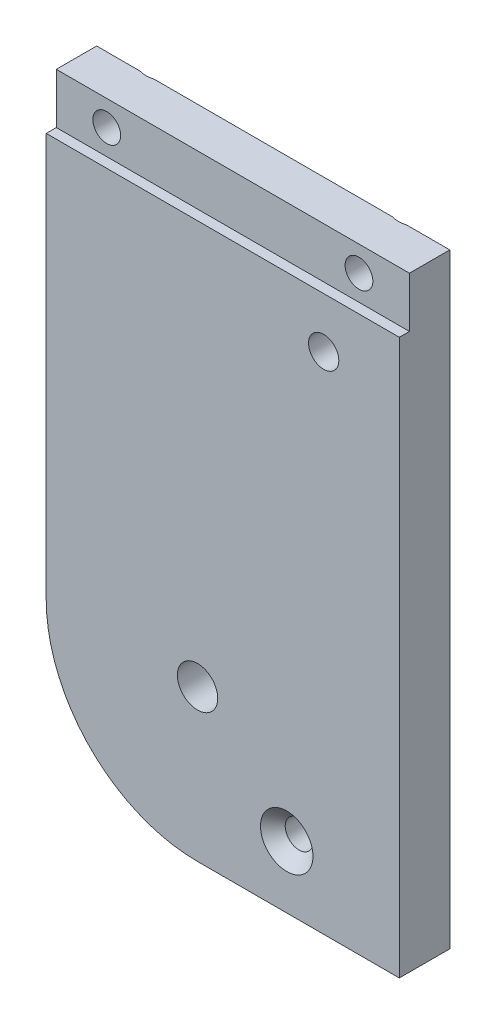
ISO-10303-21;
HEADER;
FILE_DESCRIPTION(('STEP AP214'),'2;1');
FILE_NAME('part.step','',(''),(''),'','','');
FILE_SCHEMA(('AUTOMOTIVE_DESIGN { 1 0 10303 214 1 1 1 1 }'));
ENDSEC;
DATA;
#1=APPLICATION_CONTEXT('core data for automotive mechanical design processes');
#2=APPLICATION_PROTOCOL_DEFINITION('international standard','automotive_design',2000,#1);
#3=PRODUCT_CONTEXT('',#1,'mechanical');
#4=PRODUCT('Part','Part','',(#3));
#5=PRODUCT_RELATED_PRODUCT_CATEGORY('part','',(#4));
#6=PRODUCT_DEFINITION_FORMATION('','',#4);
#7=PRODUCT_DEFINITION_CONTEXT('part definition',#1,'design');
#8=PRODUCT_DEFINITION('design','',#6,#7);
#9=PRODUCT_DEFINITION_SHAPE('','',#8);
#10=(LENGTH_UNIT() NAMED_UNIT(*) SI_UNIT(.MILLI.,.METRE.));
#11=(NAMED_UNIT(*) PLANE_ANGLE_UNIT() SI_UNIT($,.RADIAN.));
#12=(NAMED_UNIT(*) SI_UNIT($,.STERADIAN.) SOLID_ANGLE_UNIT());
#13=UNCERTAINTY_MEASURE_WITH_UNIT(LENGTH_MEASURE(1.E-05),#10,'distance_accuracy_value','');
#14=(GEOMETRIC_REPRESENTATION_CONTEXT(3) GLOBAL_UNCERTAINTY_ASSIGNED_CONTEXT((#13)) GLOBAL_UNIT_ASSIGNED_CONTEXT((#10,
#11,#12)) REPRESENTATION_CONTEXT('',''));
#15=CARTESIAN_POINT('',(0.,0.,0.));
#16=DIRECTION('',(0.,0.,1.));
#17=DIRECTION('',(1.,0.,0.));
#18=AXIS2_PLACEMENT_3D('',#15,#16,#17);
#19=CARTESIAN_POINT('',(-50.,45.,10.));
#20=DIRECTION('',(0.,0.,1.));
#21=DIRECTION('',(1.,0.,0.));
#22=AXIS2_PLACEMENT_3D('',#19,#20,#21);
#23=PLANE('',#22);
#24=CARTESIAN_POINT('',(-32.3223304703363,27.3223304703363,10.));
#25=DIRECTION('',(0.,0.,1.));
#26=DIRECTION('',(1.,0.,0.));
#27=AXIS2_PLACEMENT_3D('',#24,#25,#26);
#28=CIRCLE('',#27,5.2);
#29=CARTESIAN_POINT('',(-27.1223304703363,27.3223304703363,10.));
#30=VERTEX_POINT('',#29);
#31=EDGE_CURVE('E184',#30,#30,#28,.T.);
#32=ORIENTED_EDGE('',*,*,#31,.F.);
#33=EDGE_LOOP('',(#32));
#34=FACE_BOUND('',#33,.T.);
#35=CARTESIAN_POINT('',(-25.,115.,10.));
#36=DIRECTION('',(0.,0.,1.));
#37=DIRECTION('',(1.,0.,0.));
#38=AXIS2_PLACEMENT_3D('',#35,#36,#37);
#39=CIRCLE('',#38,3.);
#40=CARTESIAN_POINT('',(-22.,115.,10.));
#41=VERTEX_POINT('',#40);
#42=EDGE_CURVE('E173',#41,#41,#39,.T.);
#43=ORIENTED_EDGE('',*,*,#42,.F.);
#44=EDGE_LOOP('',(#43));
#45=FACE_BOUND('',#44,.T.);
#46=DIRECTION('',(1.,0.,0.));
#47=VECTOR('',#46,1.);
#48=CARTESIAN_POINT('',(-80.,125.,10.));
#49=LINE('',#48,#47);
#50=CARTESIAN_POINT('',(-80.,125.,10.));
#51=VERTEX_POINT('',#50);
#52=CARTESIAN_POINT('',(-10.,125.,10.));
#53=VERTEX_POINT('',#52);
#54=EDGE_CURVE('E156',#51,#53,#49,.T.);
#55=ORIENTED_EDGE('',*,*,#54,.F.);
#56=DIRECTION('',(0.,-1.,0.));
#57=VECTOR('',#56,1.);
#58=CARTESIAN_POINT('',(-80.,135.,10.));
#59=LINE('',#58,#57);
#60=CARTESIAN_POINT('',(-80.,45.,10.));
#61=VERTEX_POINT('',#60);
#62=EDGE_CURVE('E121',#51,#61,#59,.T.);
#63=ORIENTED_EDGE('',*,*,#62,.T.);
#64=CARTESIAN_POINT('',(-50.,45.,10.));
#65=DIRECTION('',(0.,0.,1.));
#66=DIRECTION('',(1.,0.,0.));
#67=AXIS2_PLACEMENT_3D('',#64,#65,#66);
#68=CIRCLE('',#67,30.);
#69=CARTESIAN_POINT('',(-50.,15.,10.));
#70=VERTEX_POINT('',#69);
#71=EDGE_CURVE('E124',#61,#70,#68,.T.);
#72=ORIENTED_EDGE('',*,*,#71,.T.);
#73=DIRECTION('',(1.,0.,0.));
#74=VECTOR('',#73,1.);
#75=CARTESIAN_POINT('',(-50.,15.,10.));
#76=LINE('',#75,#74);
#77=CARTESIAN_POINT('',(-9.99999999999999,15.,10.));
#78=VERTEX_POINT('',#77);
#79=EDGE_CURVE('E147',#70,#78,#76,.T.);
#80=ORIENTED_EDGE('',*,*,#79,.T.);
#81=DIRECTION('',(0.,1.,0.));
#82=VECTOR('',#81,1.);
#83=CARTESIAN_POINT('',(-10.,135.,10.));
#84=LINE('',#83,#82);
#85=EDGE_CURVE('E143',#78,#53,#84,.T.);
#86=ORIENTED_EDGE('',*,*,#85,.T.);
#87=EDGE_LOOP('',(#55,#63,#72,#80,#86));
#88=FACE_BOUND('',#87,.T.);
#89=CARTESIAN_POINT('',(-50.,45.,10.));
#90=DIRECTION('',(0.,0.,1.));
#91=DIRECTION('',(1.,0.,0.));
#92=AXIS2_PLACEMENT_3D('',#89,#90,#91);
#93=CIRCLE('',#92,4.00000000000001);
#94=CARTESIAN_POINT('',(-46.,45.,10.));
#95=VERTEX_POINT('',#94);
#96=EDGE_CURVE('E142',#95,#95,#93,.T.);
#97=ORIENTED_EDGE('',*,*,#96,.F.);
#98=EDGE_LOOP('',(#97));
#99=FACE_BOUND('',#98,.T.);
#100=ADVANCED_FACE('F34',(#34,#45,#88,#99),#23,.T.);
#101=CARTESIAN_POINT('',(-50.,45.,0.));
#102=DIRECTION('',(0.,0.,1.));
#103=DIRECTION('',(1.,0.,0.));
#104=AXIS2_PLACEMENT_3D('',#101,#102,#103);
#105=PLANE('',#104);
#106=CARTESIAN_POINT('',(-32.3223304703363,27.3223304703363,0.));
#107=DIRECTION('',(0.,0.,1.));
#108=DIRECTION('',(1.,0.,0.));
#109=AXIS2_PLACEMENT_3D('',#106,#107,#108);
#110=CIRCLE('',#109,2.74999999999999);
#111=CARTESIAN_POINT('',(-29.5723304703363,27.3223304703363,0.));
#112=VERTEX_POINT('',#111);
#113=EDGE_CURVE('E176',#112,#112,#110,.T.);
#114=ORIENTED_EDGE('',*,*,#113,.T.);
#115=EDGE_LOOP('',(#114));
#116=FACE_BOUND('',#115,.T.);
#117=CARTESIAN_POINT('',(-25.,115.,0.));
#118=DIRECTION('',(0.,0.,1.));
#119=DIRECTION('',(1.,0.,0.));
#120=AXIS2_PLACEMENT_3D('',#117,#118,#119);
#121=CIRCLE('',#120,3.);
#122=CARTESIAN_POINT('',(-22.,115.,0.));
#123=VERTEX_POINT('',#122);
#124=EDGE_CURVE('E168',#123,#123,#121,.T.);
#125=ORIENTED_EDGE('',*,*,#124,.T.);
#126=EDGE_LOOP('',(#125));
#127=FACE_BOUND('',#126,.T.);
#128=DIRECTION('',(-1.,0.,0.));
#129=VECTOR('',#128,1.);
#130=CARTESIAN_POINT('',(-80.,135.,0.));
#131=LINE('',#130,#129);
#132=CARTESIAN_POINT('',(-21.4282856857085,135.,0.));
#133=VERTEX_POINT('',#132);
#134=CARTESIAN_POINT('',(-68.5717143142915,135.,0.));
#135=VERTEX_POINT('',#134);
#136=EDGE_CURVE('E113',#133,#135,#131,.T.);
#137=ORIENTED_EDGE('',*,*,#136,.F.);
#138=CARTESIAN_POINT('',(-20.,130.,0.));
#139=DIRECTION('',(0.,0.,-1.));
#140=DIRECTION('',(-1.,0.,0.));
#141=AXIS2_PLACEMENT_3D('',#138,#139,#140);
#142=CIRCLE('',#141,5.2);
#143=CARTESIAN_POINT('',(-18.5717143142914,135.,0.));
#144=VERTEX_POINT('',#143);
#145=EDGE_CURVE('E49',#144,#133,#142,.T.);
#146=ORIENTED_EDGE('',*,*,#145,.F.);
#147=CARTESIAN_POINT('',(-10.,135.,0.));
#148=VERTEX_POINT('',#147);
#149=EDGE_CURVE('E112',#148,#144,#131,.T.);
#150=ORIENTED_EDGE('',*,*,#149,.F.);
#151=DIRECTION('',(0.,1.,0.));
#152=VECTOR('',#151,1.);
#153=CARTESIAN_POINT('',(-10.,135.,0.));
#154=LINE('',#153,#152);
#155=CARTESIAN_POINT('',(-9.99999999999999,15.,0.));
#156=VERTEX_POINT('',#155);
#157=EDGE_CURVE('E128',#156,#148,#154,.T.);
#158=ORIENTED_EDGE('',*,*,#157,.F.);
#159=DIRECTION('',(1.,0.,0.));
#160=VECTOR('',#159,1.);
#161=CARTESIAN_POINT('',(-50.,15.,0.));
#162=LINE('',#161,#160);
#163=CARTESIAN_POINT('',(-50.,15.,0.));
#164=VERTEX_POINT('',#163);
#165=EDGE_CURVE('E132',#164,#156,#162,.T.);
#166=ORIENTED_EDGE('',*,*,#165,.F.);
#167=CARTESIAN_POINT('',(-50.,45.,0.));
#168=DIRECTION('',(0.,0.,1.));
#169=DIRECTION('',(1.,0.,0.));
#170=AXIS2_PLACEMENT_3D('',#167,#168,#169);
#171=CIRCLE('',#170,30.);
#172=CARTESIAN_POINT('',(-80.,45.,0.));
#173=VERTEX_POINT('',#172);
#174=EDGE_CURVE('E135',#173,#164,#171,.T.);
#175=ORIENTED_EDGE('',*,*,#174,.F.);
#176=DIRECTION('',(0.,-1.,0.));
#177=VECTOR('',#176,1.);
#178=CARTESIAN_POINT('',(-80.,135.,0.));
#179=LINE('',#178,#177);
#180=CARTESIAN_POINT('',(-80.,135.,0.));
#181=VERTEX_POINT('',#180);
#182=EDGE_CURVE('E139',#181,#173,#179,.T.);
#183=ORIENTED_EDGE('',*,*,#182,.F.);
#184=CARTESIAN_POINT('',(-71.4282856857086,135.,0.));
#185=VERTEX_POINT('',#184);
#186=EDGE_CURVE('E123',#185,#181,#131,.T.);
#187=ORIENTED_EDGE('',*,*,#186,.F.);
#188=CARTESIAN_POINT('',(-70.,130.,0.));
#189=DIRECTION('',(0.,0.,-1.));
#190=DIRECTION('',(-1.,0.,0.));
#191=AXIS2_PLACEMENT_3D('',#188,#189,#190);
#192=CIRCLE('',#191,5.2);
#193=EDGE_CURVE('E55',#135,#185,#192,.T.);
#194=ORIENTED_EDGE('',*,*,#193,.F.);
#195=EDGE_LOOP('',(#137,#146,#150,#158,#166,#175,#183,#187,#194));
#196=FACE_BOUND('',#195,.T.);
#197=CARTESIAN_POINT('',(-50.,45.,0.));
#198=DIRECTION('',(0.,0.,1.));
#199=DIRECTION('',(1.,0.,0.));
#200=AXIS2_PLACEMENT_3D('',#197,#198,#199);
#201=CIRCLE('',#200,4.00000000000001);
#202=CARTESIAN_POINT('',(-46.,45.,0.));
#203=VERTEX_POINT('',#202);
#204=EDGE_CURVE('E150',#203,#203,#201,.T.);
#205=ORIENTED_EDGE('',*,*,#204,.T.);
#206=EDGE_LOOP('',(#205));
#207=FACE_BOUND('',#206,.T.);
#208=ADVANCED_FACE('F109',(#116,#127,#196,#207),#105,.F.);
#209=CARTESIAN_POINT('',(-80.,135.,10.));
#210=DIRECTION('',(1.,0.,0.));
#211=DIRECTION('',(0.,1.,0.));
#212=AXIS2_PLACEMENT_3D('',#209,#210,#211);
#213=PLANE('',#212);
#214=DIRECTION('',(0.,0.,-1.));
#215=VECTOR('',#214,1.);
#216=CARTESIAN_POINT('',(-80.,125.,10.));
#217=LINE('',#216,#215);
#218=CARTESIAN_POINT('',(-80.,125.,8.));
#219=VERTEX_POINT('',#218);
#220=EDGE_CURVE('E164',#51,#219,#217,.T.);
#221=ORIENTED_EDGE('',*,*,#220,.T.);
#222=DIRECTION('',(0.,1.,0.));
#223=VECTOR('',#222,1.);
#224=CARTESIAN_POINT('',(-80.,135.,8.));
#225=LINE('',#224,#223);
#226=CARTESIAN_POINT('',(-80.,135.,8.));
#227=VERTEX_POINT('',#226);
#228=EDGE_CURVE('E159',#219,#227,#225,.T.);
#229=ORIENTED_EDGE('',*,*,#228,.T.);
#230=DIRECTION('',(0.,0.,-1.));
#231=VECTOR('',#230,1.);
#232=CARTESIAN_POINT('',(-80.,135.,10.));
#233=LINE('',#232,#231);
#234=EDGE_CURVE('E146',#227,#181,#233,.T.);
#235=ORIENTED_EDGE('',*,*,#234,.T.);
#236=ORIENTED_EDGE('',*,*,#182,.T.);
#237=DIRECTION('',(0.,0.,-1.));
#238=VECTOR('',#237,1.);
#239=CARTESIAN_POINT('',(-80.,45.,10.));
#240=LINE('',#239,#238);
#241=EDGE_CURVE('E286',#61,#173,#240,.T.);
#242=ORIENTED_EDGE('',*,*,#241,.F.);
#243=ORIENTED_EDGE('',*,*,#62,.F.);
#244=EDGE_LOOP('',(#221,#229,#235,#236,#242,#243));
#245=FACE_BOUND('',#244,.T.);
#246=ADVANCED_FACE('F36',(#245),#213,.F.);
#247=CARTESIAN_POINT('',(-50.,45.,10.));
#248=DIRECTION('',(0.,0.,-1.));
#249=DIRECTION('',(-1.,0.,0.));
#250=AXIS2_PLACEMENT_3D('',#247,#248,#249);
#251=CYLINDRICAL_SURFACE('',#250,30.);
#252=ORIENTED_EDGE('',*,*,#174,.T.);
#253=DIRECTION('',(0.,0.,-1.));
#254=VECTOR('',#253,1.);
#255=CARTESIAN_POINT('',(-50.,15.,10.));
#256=LINE('',#255,#254);
#257=EDGE_CURVE('E284',#70,#164,#256,.T.);
#258=ORIENTED_EDGE('',*,*,#257,.F.);
#259=ORIENTED_EDGE('',*,*,#71,.F.);
#260=ORIENTED_EDGE('',*,*,#241,.T.);
#261=EDGE_LOOP('',(#252,#258,#259,#260));
#262=FACE_BOUND('',#261,.T.);
#263=ADVANCED_FACE('F296',(#262),#251,.T.);
#264=CARTESIAN_POINT('',(-50.,15.,10.));
#265=DIRECTION('',(0.,1.,0.));
#266=DIRECTION('',(0.,0.,1.));
#267=AXIS2_PLACEMENT_3D('',#264,#265,#266);
#268=PLANE('',#267);
#269=ORIENTED_EDGE('',*,*,#165,.T.);
#270=DIRECTION('',(0.,0.,-1.));
#271=VECTOR('',#270,1.);
#272=CARTESIAN_POINT('',(-9.99999999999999,15.,10.));
#273=LINE('',#272,#271);
#274=EDGE_CURVE('E280',#78,#156,#273,.T.);
#275=ORIENTED_EDGE('',*,*,#274,.F.);
#276=ORIENTED_EDGE('',*,*,#79,.F.);
#277=ORIENTED_EDGE('',*,*,#257,.T.);
#278=EDGE_LOOP('',(#269,#275,#276,#277));
#279=FACE_BOUND('',#278,.T.);
#280=ADVANCED_FACE('F300',(#279),#268,.F.);
#281=CARTESIAN_POINT('',(-10.,135.,10.));
#282=DIRECTION('',(-1.,0.,0.));
#283=DIRECTION('',(0.,-1.,0.));
#284=AXIS2_PLACEMENT_3D('',#281,#282,#283);
#285=PLANE('',#284);
#286=DIRECTION('',(0.,0.,-1.));
#287=VECTOR('',#286,1.);
#288=CARTESIAN_POINT('',(-10.,135.,10.));
#289=LINE('',#288,#287);
#290=CARTESIAN_POINT('',(-10.,135.,8.));
#291=VERTEX_POINT('',#290);
#292=EDGE_CURVE('E119',#291,#148,#289,.T.);
#293=ORIENTED_EDGE('',*,*,#292,.F.);
#294=DIRECTION('',(0.,1.,0.));
#295=VECTOR('',#294,1.);
#296=CARTESIAN_POINT('',(-10.,135.,8.));
#297=LINE('',#296,#295);
#298=CARTESIAN_POINT('',(-10.,125.,8.));
#299=VERTEX_POINT('',#298);
#300=EDGE_CURVE('E162',#299,#291,#297,.T.);
#301=ORIENTED_EDGE('',*,*,#300,.F.);
#302=DIRECTION('',(0.,0.,-1.));
#303=VECTOR('',#302,1.);
#304=CARTESIAN_POINT('',(-10.,125.,10.));
#305=LINE('',#304,#303);
#306=EDGE_CURVE('E165',#53,#299,#305,.T.);
#307=ORIENTED_EDGE('',*,*,#306,.F.);
#308=ORIENTED_EDGE('',*,*,#85,.F.);
#309=ORIENTED_EDGE('',*,*,#274,.T.);
#310=ORIENTED_EDGE('',*,*,#157,.T.);
#311=EDGE_LOOP('',(#293,#301,#307,#308,#309,#310));
#312=FACE_BOUND('',#311,.T.);
#313=ADVANCED_FACE('F231',(#312),#285,.F.);
#314=CARTESIAN_POINT('',(-80.,135.,10.));
#315=DIRECTION('',(0.,-1.,0.));
#316=DIRECTION('',(0.,0.,-1.));
#317=AXIS2_PLACEMENT_3D('',#314,#315,#316);
#318=PLANE('',#317);
#319=ORIENTED_EDGE('',*,*,#149,.T.);
#320=CARTESIAN_POINT('',(-37.1405688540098,135.,-12.6549461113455));
#321=CARTESIAN_POINT('',(-36.715837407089,135.,-12.247244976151));
#322=CARTESIAN_POINT('',(-36.2905460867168,135.,-11.8401243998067));
#323=CARTESIAN_POINT('',(-35.4384550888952,135.,-11.027420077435));
#324=CARTESIAN_POINT('',(-35.0116553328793,135.,-10.6218364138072));
#325=CARTESIAN_POINT('',(-34.1550195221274,135.,-9.81150466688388));
#326=CARTESIAN_POINT('',(-33.725178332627,135.,-9.40676200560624));
#327=CARTESIAN_POINT('',(-32.8631011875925,135.,-8.59986764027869));
#328=CARTESIAN_POINT('',(-32.4308653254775,135.,-8.19771583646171));
#329=CARTESIAN_POINT('',(-31.5114851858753,135.,-7.34907007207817));
#330=CARTESIAN_POINT('',(-31.023940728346,135.,-6.9030082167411));
#331=CARTESIAN_POINT('',(-30.2883897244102,135.,-6.23853245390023));
#332=CARTESIAN_POINT('',(-30.0424828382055,135.,-6.01779462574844));
#333=CARTESIAN_POINT('',(-29.5489697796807,135.,-5.57822809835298));
#334=CARTESIAN_POINT('',(-29.3013636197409,135.,-5.35939938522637));
#335=CARTESIAN_POINT('',(-28.8044825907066,135.,-4.92445100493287));
#336=CARTESIAN_POINT('',(-28.5552110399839,135.,-4.70832755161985));
#337=CARTESIAN_POINT('',(-28.0541310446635,135.,-4.27904577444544));
#338=CARTESIAN_POINT('',(-27.8023226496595,135.,-4.06588739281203));
#339=CARTESIAN_POINT('',(-27.2955867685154,135.,-3.64341598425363));
#340=CARTESIAN_POINT('',(-27.0406599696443,135.,-3.4341021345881));
#341=CARTESIAN_POINT('',(-26.5268054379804,135.,-3.0204556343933));
#342=CARTESIAN_POINT('',(-26.2678779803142,135.,-2.816122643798));
#343=CARTESIAN_POINT('',(-25.8388641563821,135.,-2.48641001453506));
#344=CARTESIAN_POINT('',(-25.6702994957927,135.,-2.35905205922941));
#345=CARTESIAN_POINT('',(-25.3306506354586,135.,-2.10771974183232));
#346=CARTESIAN_POINT('',(-25.1595663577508,135.,-1.98374548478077));
#347=CARTESIAN_POINT('',(-24.8141013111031,135.,-1.73978264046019));
#348=CARTESIAN_POINT('',(-24.6397150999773,135.,-1.61980173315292));
#349=CARTESIAN_POINT('',(-24.2873890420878,135.,-1.38516706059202));
#350=CARTESIAN_POINT('',(-24.109449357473,135.,-1.27051305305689));
#351=CARTESIAN_POINT('',(-23.7530138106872,135.,-1.05026990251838));
#352=CARTESIAN_POINT('',(-23.5746031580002,135.,-0.944543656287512));
#353=CARTESIAN_POINT('',(-23.2129842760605,135.,-0.741454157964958));
#354=CARTESIAN_POINT('',(-23.0297748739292,135.,-0.644092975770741));
#355=CARTESIAN_POINT('',(-22.6585047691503,135.,-0.460537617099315));
#356=CARTESIAN_POINT('',(-22.4704609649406,135.,-0.374309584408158));
#357=CARTESIAN_POINT('',(-22.0885962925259,135.,-0.215913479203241));
#358=CARTESIAN_POINT('',(-21.8947801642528,135.,-0.14373421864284));
#359=CARTESIAN_POINT('',(-21.5737570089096,135.,-0.0405016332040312));
#360=CARTESIAN_POINT('',(-21.4482721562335,135.,-0.00408671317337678));
#361=CARTESIAN_POINT('',(-21.1951822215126,135.,0.0605935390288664));
#362=CARTESIAN_POINT('',(-21.0675769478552,135.,0.0888581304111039));
#363=CARTESIAN_POINT('',(-20.8110095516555,135.,0.1362174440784));
#364=CARTESIAN_POINT('',(-20.6820519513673,135.,0.155336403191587));
#365=CARTESIAN_POINT('',(-20.423062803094,135.,0.183784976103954));
#366=CARTESIAN_POINT('',(-20.2930313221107,135.,0.193115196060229));
#367=CARTESIAN_POINT('',(-20.0047245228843,135.,0.20249093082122));
#368=CARTESIAN_POINT('',(-19.8463638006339,135.,0.20012036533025));
#369=CARTESIAN_POINT('',(-19.5305720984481,135.,0.180487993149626));
#370=CARTESIAN_POINT('',(-19.3731412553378,135.,0.163224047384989));
#371=CARTESIAN_POINT('',(-19.059808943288,135.,0.114738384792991));
#372=CARTESIAN_POINT('',(-18.9039164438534,135.,0.0834594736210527));
#373=CARTESIAN_POINT('',(-18.5951683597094,135.,0.00855445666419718));
#374=CARTESIAN_POINT('',(-18.4423131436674,135.,-0.035073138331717));
#375=CARTESIAN_POINT('',(-17.9909544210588,135.,-0.18102628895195));
#376=CARTESIAN_POINT('',(-17.6974212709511,135.,-0.29881796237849));
#377=CARTESIAN_POINT('',(-17.2671339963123,135.,-0.496694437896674));
#378=CARTESIAN_POINT('',(-17.1252372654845,135.,-0.566264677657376));
#379=CARTESIAN_POINT('',(-16.8444604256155,135.,-0.711258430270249));
#380=CARTESIAN_POINT('',(-16.7055798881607,135.,-0.786681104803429));
#381=CARTESIAN_POINT('',(-16.4286000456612,135.,-0.943425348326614));
#382=CARTESIAN_POINT('',(-16.2905399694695,135.,-1.02481557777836));
#383=CARTESIAN_POINT('',(-16.0169002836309,135.,-1.19166077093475));
#384=CARTESIAN_POINT('',(-15.8813207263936,135.,-1.2771158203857));
#385=CARTESIAN_POINT('',(-15.6124622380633,135.,-1.45131623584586));
#386=CARTESIAN_POINT('',(-15.4791814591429,135.,-1.54005875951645));
#387=CARTESIAN_POINT('',(-15.2145445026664,135.,-1.72034886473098));
#388=CARTESIAN_POINT('',(-15.0831882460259,135.,-1.81189633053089));
#389=CARTESIAN_POINT('',(-14.6528731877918,135.,-2.11758394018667));
#390=CARTESIAN_POINT('',(-14.3574773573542,135.,-2.3367415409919));
#391=CARTESIAN_POINT('',(-13.7731960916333,135.,-2.78359714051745));
#392=CARTESIAN_POINT('',(-13.4843119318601,135.,-3.01129678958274));
#393=CARTESIAN_POINT('',(-12.9113238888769,135.,-3.47297769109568));
#394=CARTESIAN_POINT('',(-12.627223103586,135.,-3.7069627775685));
#395=CARTESIAN_POINT('',(-12.0628646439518,135.,-4.17946424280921));
#396=CARTESIAN_POINT('',(-11.782606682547,135.,-4.41798027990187));
#397=CARTESIAN_POINT('',(-11.2243414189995,135.,-4.89911415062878));
#398=CARTESIAN_POINT('',(-10.9463420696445,135.,-5.14174119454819));
#399=CARTESIAN_POINT('',(-10.3927297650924,135.,-5.62970750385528));
#400=CARTESIAN_POINT('',(-10.1171168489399,135.,-5.87504681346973));
#401=CARTESIAN_POINT('',(-9.56791837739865,135.,-6.36778414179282));
#402=CARTESIAN_POINT('',(-9.29433212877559,135.,-6.61518138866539));
#403=CARTESIAN_POINT('',(-8.74873623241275,135.,-7.11170914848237));
#404=CARTESIAN_POINT('',(-8.4767265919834,135.,-7.36083966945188));
#405=CARTESIAN_POINT('',(-7.72906189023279,135.,-8.04919672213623));
#406=CARTESIAN_POINT('',(-7.25475730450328,135.,-8.4898897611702));
#407=CARTESIAN_POINT('',(-6.30903454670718,135.,-9.37445352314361));
#408=CARTESIAN_POINT('',(-5.83761667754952,135.,-9.81832456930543));
#409=CARTESIAN_POINT('',(-4.89930094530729,135.,-10.7062286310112));
#410=CARTESIAN_POINT('',(-4.43239225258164,135.,-11.1502502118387));
#411=CARTESIAN_POINT('',(-3.50036096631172,135.,-12.0400507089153));
#412=CARTESIAN_POINT('',(-3.03523816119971,135.,-12.4858294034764));
#413=CARTESIAN_POINT('',(-2.5707465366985,135.,-12.9322606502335));
#414=B_SPLINE_CURVE_WITH_KNOTS('',3,(#320,#321,#322,#323,#324,#325,#326,#327,#328,#329,#330,
#331,#332,#333,#334,#335,#336,#337,#338,#339,#340,#341,#342,#343,#344,#345,#346,#347,#348,#349,
#350,#351,#352,#353,#354,#355,#356,#357,#358,#359,#360,#361,#362,#363,#364,#365,#366,#367,#368,
#369,#370,#371,#372,#373,#374,#375,#376,#377,#378,#379,#380,#381,#382,#383,#384,#385,#386,#387,
#388,#389,#390,#391,#392,#393,#394,#395,#396,#397,#398,#399,#400,#401,#402,#403,#404,#405,#406,
#407,#408,#409,#410,#411,#412,#413),.UNSPECIFIED.,.F.,.F.,(4,2,2,2,2,2,2,2,2,2,2,2,2,2,2,2,2,2,
2,2,2,2,2,2,2,2,2,2,2,2,2,2,2,2,2,2,2,2,2,2,2,2,2,2,2,2,4),(0.,1.766227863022,3.53254911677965,
5.30376047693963,7.07490321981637,9.05729190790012,10.0486261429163,11.0399531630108,
12.0296881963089,13.0194039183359,14.0089053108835,14.9983389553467,15.6321095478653,
16.2658997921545,16.9008457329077,17.5357627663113,18.1577427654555,18.7798762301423,
19.4000708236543,20.01976947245,20.411525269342,20.8033166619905,21.1940639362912,
21.5847870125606,22.0591797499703,22.5336406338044,23.0100556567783,23.4865281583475,
24.4327240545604,24.9067676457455,25.3807434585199,25.8614629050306,26.3421924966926,
26.8225157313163,27.3028191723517,28.4060062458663,29.5094075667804,30.6134979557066,
31.7175054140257,32.8244445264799,33.9314017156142,35.0379609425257,36.1445252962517,
38.0868153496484,40.0293058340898,41.9622851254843,43.8950278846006),.UNSPECIFIED.);
#415=EDGE_CURVE('E11',#144,#133,#414,.F.);
#416=ORIENTED_EDGE('',*,*,#415,.T.);
#417=ORIENTED_EDGE('',*,*,#136,.T.);
#418=CARTESIAN_POINT('',(-87.1405688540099,135.,-12.6549461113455));
#419=CARTESIAN_POINT('',(-86.7158374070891,135.,-12.247244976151));
#420=CARTESIAN_POINT('',(-86.2905460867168,135.,-11.8401243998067));
#421=CARTESIAN_POINT('',(-85.4384550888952,135.,-11.0274200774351));
#422=CARTESIAN_POINT('',(-85.0116553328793,135.,-10.6218364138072));
#423=CARTESIAN_POINT('',(-84.1550195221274,135.,-9.81150466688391));
#424=CARTESIAN_POINT('',(-83.7251783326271,135.,-9.40676200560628));
#425=CARTESIAN_POINT('',(-82.8631011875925,135.,-8.59986764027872));
#426=CARTESIAN_POINT('',(-82.4308653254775,135.,-8.19771583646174));
#427=CARTESIAN_POINT('',(-81.5114851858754,135.,-7.34907007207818));
#428=CARTESIAN_POINT('',(-81.023940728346,135.,-6.90300821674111));
#429=CARTESIAN_POINT('',(-80.2883897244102,135.,-6.23853245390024));
#430=CARTESIAN_POINT('',(-80.0424828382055,135.,-6.01779462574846));
#431=CARTESIAN_POINT('',(-79.5489697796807,135.,-5.57822809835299));
#432=CARTESIAN_POINT('',(-79.3013636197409,135.,-5.35939938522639));
#433=CARTESIAN_POINT('',(-78.8044825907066,135.,-4.92445100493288));
#434=CARTESIAN_POINT('',(-78.5552110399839,135.,-4.70832755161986));
#435=CARTESIAN_POINT('',(-78.0541310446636,135.,-4.27904577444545));
#436=CARTESIAN_POINT('',(-77.8023226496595,135.,-4.06588739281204));
#437=CARTESIAN_POINT('',(-77.2955867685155,135.,-3.64341598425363));
#438=CARTESIAN_POINT('',(-77.0406599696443,135.,-3.43410213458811));
#439=CARTESIAN_POINT('',(-76.5268054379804,135.,-3.0204556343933));
#440=CARTESIAN_POINT('',(-76.2678779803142,135.,-2.816122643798));
#441=CARTESIAN_POINT('',(-75.8388641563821,135.,-2.48641001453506));
#442=CARTESIAN_POINT('',(-75.6702994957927,135.,-2.35905205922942));
#443=CARTESIAN_POINT('',(-75.3306506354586,135.,-2.10771974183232));
#444=CARTESIAN_POINT('',(-75.1595663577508,135.,-1.98374548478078));
#445=CARTESIAN_POINT('',(-74.8141013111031,135.,-1.7397826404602));
#446=CARTESIAN_POINT('',(-74.6397150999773,135.,-1.61980173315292));
#447=CARTESIAN_POINT('',(-74.2873890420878,135.,-1.38516706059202));
#448=CARTESIAN_POINT('',(-74.109449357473,135.,-1.2705130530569));
#449=CARTESIAN_POINT('',(-73.7530138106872,135.,-1.05026990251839));
#450=CARTESIAN_POINT('',(-73.5746031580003,135.,-0.94454365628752));
#451=CARTESIAN_POINT('',(-73.2129842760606,135.,-0.741454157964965));
#452=CARTESIAN_POINT('',(-73.0297748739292,135.,-0.644092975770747));
#453=CARTESIAN_POINT('',(-72.6585047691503,135.,-0.460537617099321));
#454=CARTESIAN_POINT('',(-72.4704609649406,135.,-0.374309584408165));
#455=CARTESIAN_POINT('',(-72.0885962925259,135.,-0.215913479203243));
#456=CARTESIAN_POINT('',(-71.8947801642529,135.,-0.143734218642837));
#457=CARTESIAN_POINT('',(-71.5737570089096,135.,-0.0405016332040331));
#458=CARTESIAN_POINT('',(-71.4482721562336,135.,-0.00408671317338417));
#459=CARTESIAN_POINT('',(-71.1951822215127,135.,0.0605935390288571));
#460=CARTESIAN_POINT('',(-71.0675769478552,135.,0.088858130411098));
#461=CARTESIAN_POINT('',(-70.8110095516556,135.,0.136217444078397));
#462=CARTESIAN_POINT('',(-70.6820519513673,135.,0.155336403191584));
#463=CARTESIAN_POINT('',(-70.4230628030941,135.,0.183784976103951));
#464=CARTESIAN_POINT('',(-70.2930313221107,135.,0.193115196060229));
#465=CARTESIAN_POINT('',(-70.0047245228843,135.,0.20249093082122));
#466=CARTESIAN_POINT('',(-69.8463638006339,135.,0.200120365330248));
#467=CARTESIAN_POINT('',(-69.5305720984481,135.,0.180487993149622));
#468=CARTESIAN_POINT('',(-69.3731412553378,135.,0.163224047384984));
#469=CARTESIAN_POINT('',(-69.059808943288,135.,0.114738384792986));
#470=CARTESIAN_POINT('',(-68.9039164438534,135.,0.0834594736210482));
#471=CARTESIAN_POINT('',(-68.5951683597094,135.,0.0085544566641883));
#472=CARTESIAN_POINT('',(-68.4423131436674,135.,-0.0350731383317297));
#473=CARTESIAN_POINT('',(-67.9909544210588,135.,-0.181026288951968));
#474=CARTESIAN_POINT('',(-67.6974212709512,135.,-0.298817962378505));
#475=CARTESIAN_POINT('',(-67.2671339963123,135.,-0.496694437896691));
#476=CARTESIAN_POINT('',(-67.1252372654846,135.,-0.566264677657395));
#477=CARTESIAN_POINT('',(-66.8444604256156,135.,-0.71125843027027));
#478=CARTESIAN_POINT('',(-66.7055798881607,135.,-0.786681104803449));
#479=CARTESIAN_POINT('',(-66.4286000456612,135.,-0.943425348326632));
#480=CARTESIAN_POINT('',(-66.2905399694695,135.,-1.02481557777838));
#481=CARTESIAN_POINT('',(-66.0169002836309,135.,-1.19166077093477));
#482=CARTESIAN_POINT('',(-65.8813207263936,135.,-1.27711582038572));
#483=CARTESIAN_POINT('',(-65.6124622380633,135.,-1.45131623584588));
#484=CARTESIAN_POINT('',(-65.4791814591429,135.,-1.54005875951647));
#485=CARTESIAN_POINT('',(-65.2145445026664,135.,-1.720348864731));
#486=CARTESIAN_POINT('',(-65.0831882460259,135.,-1.81189633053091));
#487=CARTESIAN_POINT('',(-64.6528731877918,135.,-2.11758394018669));
#488=CARTESIAN_POINT('',(-64.3574773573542,135.,-2.33674154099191));
#489=CARTESIAN_POINT('',(-63.7731960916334,135.,-2.78359714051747));
#490=CARTESIAN_POINT('',(-63.4843119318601,135.,-3.01129678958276));
#491=CARTESIAN_POINT('',(-62.9113238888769,135.,-3.4729776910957));
#492=CARTESIAN_POINT('',(-62.6272231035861,135.,-3.70696277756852));
#493=CARTESIAN_POINT('',(-62.0628646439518,135.,-4.17946424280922));
#494=CARTESIAN_POINT('',(-61.782606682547,135.,-4.41798027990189));
#495=CARTESIAN_POINT('',(-61.2243414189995,135.,-4.8991141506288));
#496=CARTESIAN_POINT('',(-60.9463420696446,135.,-5.14174119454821));
#497=CARTESIAN_POINT('',(-60.3927297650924,135.,-5.62970750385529));
#498=CARTESIAN_POINT('',(-60.1171168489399,135.,-5.87504681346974));
#499=CARTESIAN_POINT('',(-59.5679183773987,135.,-6.36778414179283));
#500=CARTESIAN_POINT('',(-59.2943321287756,135.,-6.6151813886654));
#501=CARTESIAN_POINT('',(-58.7487362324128,135.,-7.11170914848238));
#502=CARTESIAN_POINT('',(-58.4767265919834,135.,-7.3608396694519));
#503=CARTESIAN_POINT('',(-57.7290618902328,135.,-8.04919672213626));
#504=CARTESIAN_POINT('',(-57.2547573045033,135.,-8.48988976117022));
#505=CARTESIAN_POINT('',(-56.3090345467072,135.,-9.37445352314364));
#506=CARTESIAN_POINT('',(-55.8376166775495,135.,-9.81832456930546));
#507=CARTESIAN_POINT('',(-54.8993009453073,135.,-10.7062286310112));
#508=CARTESIAN_POINT('',(-54.4323922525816,135.,-11.1502502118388));
#509=CARTESIAN_POINT('',(-53.5003609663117,135.,-12.0400507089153));
#510=CARTESIAN_POINT('',(-53.0352381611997,135.,-12.4858294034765));
#511=CARTESIAN_POINT('',(-52.5707465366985,135.,-12.9322606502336));
#512=B_SPLINE_CURVE_WITH_KNOTS('',3,(#418,#419,#420,#421,#422,#423,#424,#425,#426,#427,#428,
#429,#430,#431,#432,#433,#434,#435,#436,#437,#438,#439,#440,#441,#442,#443,#444,#445,#446,#447,
#448,#449,#450,#451,#452,#453,#454,#455,#456,#457,#458,#459,#460,#461,#462,#463,#464,#465,#466,
#467,#468,#469,#470,#471,#472,#473,#474,#475,#476,#477,#478,#479,#480,#481,#482,#483,#484,#485,
#486,#487,#488,#489,#490,#491,#492,#493,#494,#495,#496,#497,#498,#499,#500,#501,#502,#503,#504,
#505,#506,#507,#508,#509,#510,#511),.UNSPECIFIED.,.F.,.F.,(4,2,2,2,2,2,2,2,2,2,2,2,2,2,2,2,2,2,
2,2,2,2,2,2,2,2,2,2,2,2,2,2,2,2,2,2,2,2,2,2,2,2,2,2,2,2,4),(0.,1.76622786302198,
3.53254911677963,5.3037604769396,7.07490321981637,9.05729190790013,10.0486261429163,
11.0399531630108,12.0296881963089,13.0194039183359,14.0089053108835,14.9983389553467,
15.6321095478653,16.2658997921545,16.9008457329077,17.5357627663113,18.1577427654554,
18.7798762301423,19.4000708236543,20.01976947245,20.411525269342,20.8033166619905,
21.1940639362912,21.5847870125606,22.0591797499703,22.5336406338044,23.0100556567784,
23.4865281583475,24.4327240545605,24.9067676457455,25.38074345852,25.8614629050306,
26.3421924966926,26.8225157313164,27.3028191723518,28.4060062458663,29.5094075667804,
30.6134979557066,31.7175054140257,32.82444452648,33.9314017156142,35.0379609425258,
36.1445252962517,38.0868153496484,40.0293058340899,41.9622851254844,43.8950278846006),.UNSPECIFIED.);
#513=EDGE_CURVE('E43',#135,#185,#512,.F.);
#514=ORIENTED_EDGE('',*,*,#513,.T.);
#515=ORIENTED_EDGE('',*,*,#186,.T.);
#516=ORIENTED_EDGE('',*,*,#234,.F.);
#517=DIRECTION('',(1.,0.,0.));
#518=VECTOR('',#517,1.);
#519=CARTESIAN_POINT('',(-80.,135.,8.));
#520=LINE('',#519,#518);
#521=EDGE_CURVE('E153',#227,#291,#520,.T.);
#522=ORIENTED_EDGE('',*,*,#521,.T.);
#523=ORIENTED_EDGE('',*,*,#292,.T.);
#524=EDGE_LOOP('',(#319,#416,#417,#514,#515,#516,#522,#523));
#525=FACE_BOUND('',#524,.T.);
#526=ADVANCED_FACE('F116',(#525),#318,.F.);
#527=CARTESIAN_POINT('',(-50.,45.,10.));
#528=DIRECTION('',(0.,0.,-1.));
#529=DIRECTION('',(-1.,0.,0.));
#530=AXIS2_PLACEMENT_3D('',#527,#528,#529);
#531=CYLINDRICAL_SURFACE('',#530,4.00000000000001);
#532=ORIENTED_EDGE('',*,*,#96,.T.);
#533=EDGE_LOOP('',(#532));
#534=FACE_BOUND('',#533,.T.);
#535=ORIENTED_EDGE('',*,*,#204,.F.);
#536=EDGE_LOOP('',(#535));
#537=FACE_BOUND('',#536,.T.);
#538=ADVANCED_FACE('F225',(#534,#537),#531,.F.);
#539=CARTESIAN_POINT('',(-80.,135.,8.));
#540=DIRECTION('',(0.,0.,-1.));
#541=DIRECTION('',(0.,1.,0.));
#542=AXIS2_PLACEMENT_3D('',#539,#540,#541);
#543=PLANE('',#542);
#544=CARTESIAN_POINT('',(-20.,130.,8.));
#545=DIRECTION('',(0.,0.,-1.));
#546=DIRECTION('',(0.,1.,0.));
#547=AXIS2_PLACEMENT_3D('',#544,#545,#546);
#548=CIRCLE('',#547,2.74999999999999);
#549=CARTESIAN_POINT('',(-20.,132.75,8.));
#550=VERTEX_POINT('',#549);
#551=EDGE_CURVE('E38',#550,#550,#548,.T.);
#552=ORIENTED_EDGE('',*,*,#551,.T.);
#553=EDGE_LOOP('',(#552));
#554=FACE_BOUND('',#553,.T.);
#555=CARTESIAN_POINT('',(-70.,130.,8.));
#556=DIRECTION('',(0.,0.,-1.));
#557=DIRECTION('',(0.,1.,0.));
#558=AXIS2_PLACEMENT_3D('',#555,#556,#557);
#559=CIRCLE('',#558,2.74999999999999);
#560=CARTESIAN_POINT('',(-70.,132.75,8.));
#561=VERTEX_POINT('',#560);
#562=EDGE_CURVE('E187',#561,#561,#559,.T.);
#563=ORIENTED_EDGE('',*,*,#562,.T.);
#564=EDGE_LOOP('',(#563));
#565=FACE_BOUND('',#564,.T.);
#566=ORIENTED_EDGE('',*,*,#300,.T.);
#567=ORIENTED_EDGE('',*,*,#521,.F.);
#568=ORIENTED_EDGE('',*,*,#228,.F.);
#569=DIRECTION('',(1.,0.,0.));
#570=VECTOR('',#569,1.);
#571=CARTESIAN_POINT('',(-80.,125.,8.));
#572=LINE('',#571,#570);
#573=EDGE_CURVE('E158',#219,#299,#572,.T.);
#574=ORIENTED_EDGE('',*,*,#573,.T.);
#575=EDGE_LOOP('',(#566,#567,#568,#574));
#576=FACE_BOUND('',#575,.T.);
#577=ADVANCED_FACE('F198',(#554,#565,#576),#543,.F.);
#578=CARTESIAN_POINT('',(-80.,125.,10.));
#579=DIRECTION('',(0.,-1.,0.));
#580=DIRECTION('',(1.,0.,0.));
#581=AXIS2_PLACEMENT_3D('',#578,#579,#580);
#582=PLANE('',#581);
#583=ORIENTED_EDGE('',*,*,#306,.T.);
#584=ORIENTED_EDGE('',*,*,#573,.F.);
#585=ORIENTED_EDGE('',*,*,#220,.F.);
#586=ORIENTED_EDGE('',*,*,#54,.T.);
#587=EDGE_LOOP('',(#583,#584,#585,#586));
#588=FACE_BOUND('',#587,.T.);
#589=ADVANCED_FACE('F266',(#588),#582,.F.);
#590=CARTESIAN_POINT('',(-25.,115.,0.));
#591=DIRECTION('',(0.,0.,1.));
#592=DIRECTION('',(1.,0.,0.));
#593=AXIS2_PLACEMENT_3D('',#590,#591,#592);
#594=CYLINDRICAL_SURFACE('',#593,3.);
#595=ORIENTED_EDGE('',*,*,#124,.F.);
#596=EDGE_LOOP('',(#595));
#597=FACE_BOUND('',#596,.T.);
#598=ORIENTED_EDGE('',*,*,#42,.T.);
#599=EDGE_LOOP('',(#598));
#600=FACE_BOUND('',#599,.T.);
#601=ADVANCED_FACE('F262',(#597,#600),#594,.F.);
#602=CARTESIAN_POINT('',(-32.3223304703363,27.3223304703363,10.));
#603=DIRECTION('',(0.,0.,1.));
#604=DIRECTION('',(1.,0.,0.));
#605=AXIS2_PLACEMENT_3D('',#602,#603,#604);
#606=CYLINDRICAL_SURFACE('',#605,2.74999999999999);
#607=ORIENTED_EDGE('',*,*,#113,.F.);
#608=EDGE_LOOP('',(#607));
#609=FACE_BOUND('',#608,.T.);
#610=CARTESIAN_POINT('',(-32.3223304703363,27.3223304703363,7.55));
#611=DIRECTION('',(0.,0.,1.));
#612=DIRECTION('',(1.,0.,0.));
#613=AXIS2_PLACEMENT_3D('',#610,#611,#612);
#614=CIRCLE('',#613,2.75);
#615=CARTESIAN_POINT('',(-29.5723304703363,27.3223304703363,7.55));
#616=VERTEX_POINT('',#615);
#617=EDGE_CURVE('E181',#616,#616,#614,.T.);
#618=ORIENTED_EDGE('',*,*,#617,.T.);
#619=EDGE_LOOP('',(#618));
#620=FACE_BOUND('',#619,.T.);
#621=ADVANCED_FACE('F255',(#609,#620),#606,.F.);
#622=CARTESIAN_POINT('',(-32.3223304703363,27.3223304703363,10.));
#623=DIRECTION('',(0.,0.,1.));
#624=DIRECTION('',(1.,0.,0.));
#625=AXIS2_PLACEMENT_3D('',#622,#623,#624);
#626=CONICAL_SURFACE('',#625,5.2,0.785398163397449);
#627=ORIENTED_EDGE('',*,*,#617,.F.);
#628=EDGE_LOOP('',(#627));
#629=FACE_BOUND('',#628,.T.);
#630=ORIENTED_EDGE('',*,*,#31,.T.);
#631=EDGE_LOOP('',(#630));
#632=FACE_BOUND('',#631,.T.);
#633=ADVANCED_FACE('F249',(#629,#632),#626,.F.);
#634=CARTESIAN_POINT('',(-70.,130.,0.));
#635=DIRECTION('',(0.,0.,-1.));
#636=DIRECTION('',(-1.,0.,0.));
#637=AXIS2_PLACEMENT_3D('',#634,#635,#636);
#638=CYLINDRICAL_SURFACE('',#637,2.74999999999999);
#639=CARTESIAN_POINT('',(-70.,130.,2.45000000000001));
#640=DIRECTION('',(0.,0.,-1.));
#641=DIRECTION('',(-1.,0.,0.));
#642=AXIS2_PLACEMENT_3D('',#639,#640,#641);
#643=CIRCLE('',#642,2.74999999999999);
#644=CARTESIAN_POINT('',(-72.75,130.,2.45000000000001));
#645=VERTEX_POINT('',#644);
#646=EDGE_CURVE('E188',#645,#645,#643,.T.);
#647=ORIENTED_EDGE('',*,*,#646,.T.);
#648=EDGE_LOOP('',(#647));
#649=FACE_BOUND('',#648,.T.);
#650=ORIENTED_EDGE('',*,*,#562,.F.);
#651=EDGE_LOOP('',(#650));
#652=FACE_BOUND('',#651,.T.);
#653=ADVANCED_FACE('F211',(#649,#652),#638,.F.);
#654=CARTESIAN_POINT('',(-70.,130.,0.));
#655=DIRECTION('',(0.,0.,-1.));
#656=DIRECTION('',(-1.,0.,0.));
#657=AXIS2_PLACEMENT_3D('',#654,#655,#656);
#658=CONICAL_SURFACE('',#657,5.2,0.785398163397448);
#659=ORIENTED_EDGE('',*,*,#646,.F.);
#660=EDGE_LOOP('',(#659));
#661=FACE_BOUND('',#660,.T.);
#662=ORIENTED_EDGE('',*,*,#193,.T.);
#663=ORIENTED_EDGE('',*,*,#513,.F.);
#664=EDGE_LOOP('',(#662,#663));
#665=FACE_BOUND('',#664,.T.);
#666=ADVANCED_FACE('F203',(#661,#665),#658,.F.);
#667=CARTESIAN_POINT('',(-20.,130.,0.));
#668=DIRECTION('',(0.,0.,-1.));
#669=DIRECTION('',(-1.,0.,0.));
#670=AXIS2_PLACEMENT_3D('',#667,#668,#669);
#671=CYLINDRICAL_SURFACE('',#670,2.74999999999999);
#672=CARTESIAN_POINT('',(-20.,130.,2.45000000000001));
#673=DIRECTION('',(0.,0.,-1.));
#674=DIRECTION('',(-1.,0.,0.));
#675=AXIS2_PLACEMENT_3D('',#672,#673,#674);
#676=CIRCLE('',#675,2.74999999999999);
#677=CARTESIAN_POINT('',(-22.75,130.,2.45000000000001));
#678=VERTEX_POINT('',#677);
#679=EDGE_CURVE('E114',#678,#678,#676,.T.);
#680=ORIENTED_EDGE('',*,*,#679,.T.);
#681=EDGE_LOOP('',(#680));
#682=FACE_BOUND('',#681,.T.);
#683=ORIENTED_EDGE('',*,*,#551,.F.);
#684=EDGE_LOOP('',(#683));
#685=FACE_BOUND('',#684,.T.);
#686=ADVANCED_FACE('F201',(#682,#685),#671,.F.);
#687=CARTESIAN_POINT('',(-20.,130.,0.));
#688=DIRECTION('',(0.,0.,-1.));
#689=DIRECTION('',(-1.,0.,0.));
#690=AXIS2_PLACEMENT_3D('',#687,#688,#689);
#691=CONICAL_SURFACE('',#690,5.2,0.785398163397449);
#692=ORIENTED_EDGE('',*,*,#679,.F.);
#693=EDGE_LOOP('',(#692));
#694=FACE_BOUND('',#693,.T.);
#695=ORIENTED_EDGE('',*,*,#145,.T.);
#696=ORIENTED_EDGE('',*,*,#415,.F.);
#697=EDGE_LOOP('',(#695,#696));
#698=FACE_BOUND('',#697,.T.);
#699=ADVANCED_FACE('F103',(#694,#698),#691,.F.);
#700=CLOSED_SHELL('',(#100,#208,#246,#263,#280,#313,#526,#538,#577,#589,#601,#621,#633,#653,
#666,#686,#699));
#701=MANIFOLD_SOLID_BREP('B2',#700);
#702=ADVANCED_BREP_SHAPE_REPRESENTATION('',(#18,#701),#14);
#703=SHAPE_DEFINITION_REPRESENTATION(#9,#702);
ENDSEC;
END-ISO-10303-21;
